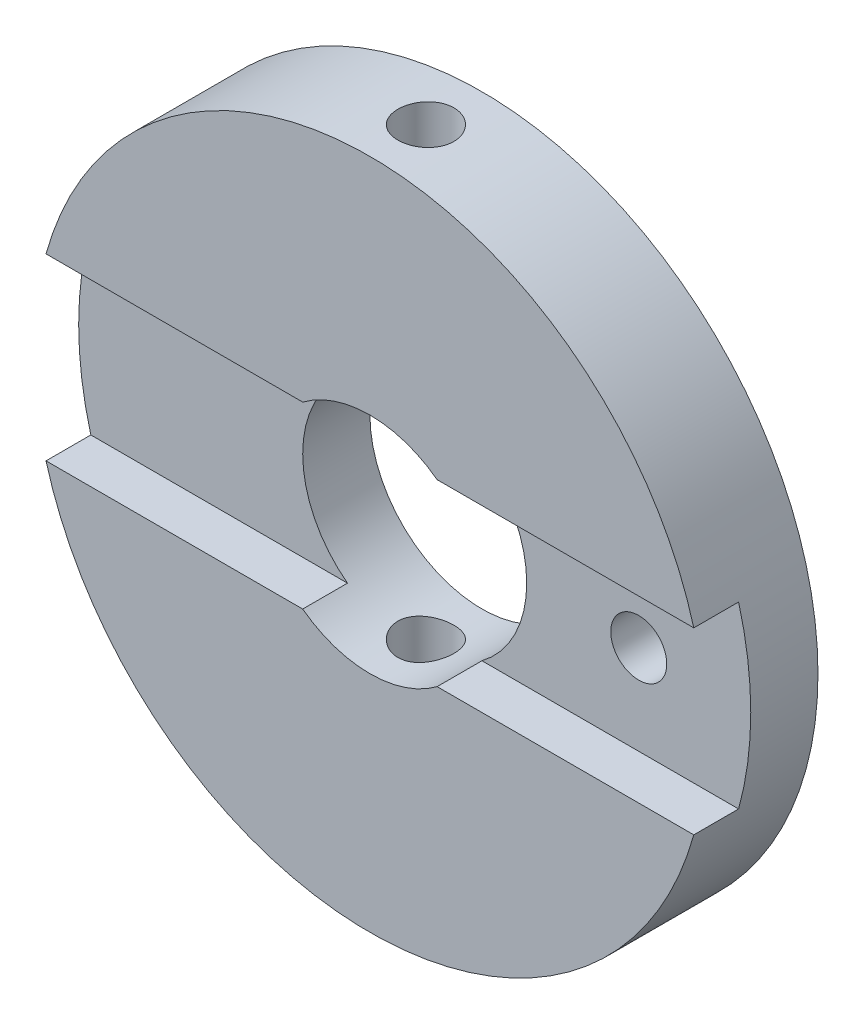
ISO-10303-21;
HEADER;
FILE_DESCRIPTION(('STEP AP214'),'2;1');
FILE_NAME('part.step','',(''),(''),'','','');
FILE_SCHEMA(('AUTOMOTIVE_DESIGN { 1 0 10303 214 1 1 1 1 }'));
ENDSEC;
DATA;
#1=APPLICATION_CONTEXT('core data for automotive mechanical design processes');
#2=APPLICATION_PROTOCOL_DEFINITION('international standard','automotive_design',2000,#1);
#3=PRODUCT_CONTEXT('',#1,'mechanical');
#4=PRODUCT('Part','Part','',(#3));
#5=PRODUCT_RELATED_PRODUCT_CATEGORY('part','',(#4));
#6=PRODUCT_DEFINITION_FORMATION('','',#4);
#7=PRODUCT_DEFINITION_CONTEXT('part definition',#1,'design');
#8=PRODUCT_DEFINITION('design','',#6,#7);
#9=PRODUCT_DEFINITION_SHAPE('','',#8);
#10=(LENGTH_UNIT() NAMED_UNIT(*) SI_UNIT(.MILLI.,.METRE.));
#11=(NAMED_UNIT(*) PLANE_ANGLE_UNIT() SI_UNIT($,.RADIAN.));
#12=(NAMED_UNIT(*) SI_UNIT($,.STERADIAN.) SOLID_ANGLE_UNIT());
#13=UNCERTAINTY_MEASURE_WITH_UNIT(LENGTH_MEASURE(1.E-05),#10,'distance_accuracy_value','');
#14=(GEOMETRIC_REPRESENTATION_CONTEXT(3) GLOBAL_UNCERTAINTY_ASSIGNED_CONTEXT((#13)) GLOBAL_UNIT_ASSIGNED_CONTEXT((#10,
#11,#12)) REPRESENTATION_CONTEXT('',''));
#15=CARTESIAN_POINT('',(0.,0.,0.));
#16=DIRECTION('',(0.,0.,1.));
#17=DIRECTION('',(1.,0.,0.));
#18=AXIS2_PLACEMENT_3D('',#15,#16,#17);
#19=CARTESIAN_POINT('',(0.,0.,5.));
#20=DIRECTION('',(0.,0.,1.));
#21=DIRECTION('',(1.,0.,0.));
#22=AXIS2_PLACEMENT_3D('',#19,#20,#21);
#23=PLANE('',#22);
#24=DIRECTION('',(1.,0.,0.));
#25=VECTOR('',#24,1.);
#26=CARTESIAN_POINT('',(-15.,-4.,5.));
#27=LINE('',#26,#25);
#28=CARTESIAN_POINT('',(-14.456832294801,-4.,5.));
#29=VERTEX_POINT('',#28);
#30=CARTESIAN_POINT('',(-3.,-4.,5.));
#31=VERTEX_POINT('',#30);
#32=EDGE_CURVE('E185',#29,#31,#27,.T.);
#33=ORIENTED_EDGE('',*,*,#32,.F.);
#34=CARTESIAN_POINT('',(0.,0.,5.));
#35=DIRECTION('',(0.,0.,1.));
#36=DIRECTION('',(1.,0.,0.));
#37=AXIS2_PLACEMENT_3D('',#34,#35,#36);
#38=CIRCLE('',#37,15.);
#39=CARTESIAN_POINT('',(14.456832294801,-4.,5.));
#40=VERTEX_POINT('',#39);
#41=EDGE_CURVE('E110',#29,#40,#38,.T.);
#42=ORIENTED_EDGE('',*,*,#41,.T.);
#43=CARTESIAN_POINT('',(3.,-4.,5.));
#44=VERTEX_POINT('',#43);
#45=EDGE_CURVE('E103',#44,#40,#27,.T.);
#46=ORIENTED_EDGE('',*,*,#45,.F.);
#47=CARTESIAN_POINT('',(0.,0.,5.));
#48=DIRECTION('',(0.,0.,1.));
#49=DIRECTION('',(1.,0.,0.));
#50=AXIS2_PLACEMENT_3D('',#47,#48,#49);
#51=CIRCLE('',#50,5.);
#52=EDGE_CURVE('E189',#31,#44,#51,.T.);
#53=ORIENTED_EDGE('',*,*,#52,.F.);
#54=EDGE_LOOP('',(#33,#42,#46,#53));
#55=FACE_BOUND('',#54,.T.);
#56=ADVANCED_FACE('F16',(#55),#23,.T.);
#57=DIRECTION('',(-1.,0.,0.));
#58=VECTOR('',#57,1.);
#59=CARTESIAN_POINT('',(-15.,4.,5.));
#60=LINE('',#59,#58);
#61=CARTESIAN_POINT('',(14.456832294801,4.,5.));
#62=VERTEX_POINT('',#61);
#63=CARTESIAN_POINT('',(3.,4.,5.));
#64=VERTEX_POINT('',#63);
#65=EDGE_CURVE('E88',#62,#64,#60,.T.);
#66=ORIENTED_EDGE('',*,*,#65,.F.);
#67=CARTESIAN_POINT('',(-14.456832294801,4.,5.));
#68=VERTEX_POINT('',#67);
#69=EDGE_CURVE('E100',#62,#68,#38,.T.);
#70=ORIENTED_EDGE('',*,*,#69,.T.);
#71=CARTESIAN_POINT('',(-3.,4.,5.));
#72=VERTEX_POINT('',#71);
#73=EDGE_CURVE('E104',#72,#68,#60,.T.);
#74=ORIENTED_EDGE('',*,*,#73,.F.);
#75=EDGE_CURVE('E102',#64,#72,#51,.T.);
#76=ORIENTED_EDGE('',*,*,#75,.F.);
#77=EDGE_LOOP('',(#66,#70,#74,#76));
#78=FACE_BOUND('',#77,.T.);
#79=ADVANCED_FACE('F98',(#78),#23,.T.);
#80=CARTESIAN_POINT('',(0.,0.,0.));
#81=DIRECTION('',(0.,0.,1.));
#82=DIRECTION('',(1.,0.,0.));
#83=AXIS2_PLACEMENT_3D('',#80,#81,#82);
#84=PLANE('',#83);
#85=CARTESIAN_POINT('',(10.,0.,0.));
#86=DIRECTION('',(0.,0.,1.));
#87=DIRECTION('',(1.,0.,0.));
#88=AXIS2_PLACEMENT_3D('',#85,#86,#87);
#89=CIRCLE('',#88,1.25);
#90=CARTESIAN_POINT('',(11.25,0.,0.));
#91=VERTEX_POINT('',#90);
#92=EDGE_CURVE('E221',#91,#91,#89,.T.);
#93=ORIENTED_EDGE('',*,*,#92,.T.);
#94=EDGE_LOOP('',(#93));
#95=FACE_BOUND('',#94,.T.);
#96=CARTESIAN_POINT('',(0.,0.,0.));
#97=DIRECTION('',(0.,0.,1.));
#98=DIRECTION('',(1.,0.,0.));
#99=AXIS2_PLACEMENT_3D('',#96,#97,#98);
#100=CIRCLE('',#99,15.);
#101=CARTESIAN_POINT('',(15.,0.,0.));
#102=VERTEX_POINT('',#101);
#103=EDGE_CURVE('E116',#102,#102,#100,.T.);
#104=ORIENTED_EDGE('',*,*,#103,.F.);
#105=EDGE_LOOP('',(#104));
#106=FACE_BOUND('',#105,.T.);
#107=CARTESIAN_POINT('',(0.,0.,0.));
#108=DIRECTION('',(0.,0.,1.));
#109=DIRECTION('',(1.,0.,0.));
#110=AXIS2_PLACEMENT_3D('',#107,#108,#109);
#111=CIRCLE('',#110,5.);
#112=CARTESIAN_POINT('',(5.,0.,0.));
#113=VERTEX_POINT('',#112);
#114=EDGE_CURVE('E119',#113,#113,#111,.T.);
#115=ORIENTED_EDGE('',*,*,#114,.T.);
#116=EDGE_LOOP('',(#115));
#117=FACE_BOUND('',#116,.T.);
#118=ADVANCED_FACE('F167',(#95,#106,#117),#84,.F.);
#119=CARTESIAN_POINT('',(0.,0.,5.));
#120=DIRECTION('',(0.,0.,-1.));
#121=DIRECTION('',(-1.,0.,0.));
#122=AXIS2_PLACEMENT_3D('',#119,#120,#121);
#123=CYLINDRICAL_SURFACE('',#122,15.);
#124=CARTESIAN_POINT('',(1.11889664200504E-13,-15.,3.75));
#125=CARTESIAN_POINT('',(0.0700826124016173,-14.9999993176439,3.74999693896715));
#126=CARTESIAN_POINT('',(0.140212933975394,-14.9995036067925,3.7440862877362));
#127=CARTESIAN_POINT('',(0.278533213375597,-14.9975737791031,3.72059456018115));
#128=CARTESIAN_POINT('',(0.346720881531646,-14.9961385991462,3.70300026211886));
#129=CARTESIAN_POINT('',(0.479132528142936,-14.9924920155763,3.65665355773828));
#130=CARTESIAN_POINT('',(0.543358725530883,-14.9902810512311,3.62790746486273));
#131=CARTESIAN_POINT('',(0.666059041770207,-14.9853308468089,3.56008446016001));
#132=CARTESIAN_POINT('',(0.724534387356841,-14.982591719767,3.52100975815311));
#133=CARTESIAN_POINT('',(0.834237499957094,-14.9768847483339,3.4335311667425));
#134=CARTESIAN_POINT('',(0.885448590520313,-14.9739164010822,3.38510639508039));
#135=CARTESIAN_POINT('',(0.979026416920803,-14.9680897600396,3.28034638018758));
#136=CARTESIAN_POINT('',(1.02139276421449,-14.965231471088,3.22401078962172));
#137=CARTESIAN_POINT('',(1.09613490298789,-14.9599431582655,3.10492735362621));
#138=CARTESIAN_POINT('',(1.12849604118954,-14.9575137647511,3.04217028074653));
#139=CARTESIAN_POINT('',(1.18221554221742,-14.9533640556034,2.91208963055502));
#140=CARTESIAN_POINT('',(1.20357409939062,-14.9516437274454,2.84476613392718));
#141=CARTESIAN_POINT('',(1.23463378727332,-14.949111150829,2.70763076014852));
#142=CARTESIAN_POINT('',(1.24436208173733,-14.9482967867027,2.63782507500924));
#143=CARTESIAN_POINT('',(1.2519690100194,-14.9476616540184,2.49756724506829));
#144=CARTESIAN_POINT('',(1.24984786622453,-14.9478408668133,2.42711511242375));
#145=CARTESIAN_POINT('',(1.23383858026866,-14.9491707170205,2.28775041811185));
#146=CARTESIAN_POINT('',(1.21997996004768,-14.9503189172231,2.21883443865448));
#147=CARTESIAN_POINT('',(1.18093498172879,-14.953453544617,2.08431016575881));
#148=CARTESIAN_POINT('',(1.15574851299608,-14.955439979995,2.01870190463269));
#149=CARTESIAN_POINT('',(1.09472973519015,-14.9600300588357,1.89256136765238));
#150=CARTESIAN_POINT('',(1.0588841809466,-14.962634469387,1.83203552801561));
#151=CARTESIAN_POINT('',(0.977574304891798,-14.9681663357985,1.71784832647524));
#152=CARTESIAN_POINT('',(0.932109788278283,-14.9710937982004,1.66418710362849));
#153=CARTESIAN_POINT('',(0.832686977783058,-14.9769527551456,1.56508072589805));
#154=CARTESIAN_POINT('',(0.77870316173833,-14.9798842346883,1.51966116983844));
#155=CARTESIAN_POINT('',(0.663863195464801,-14.9854123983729,1.43852534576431));
#156=CARTESIAN_POINT('',(0.60300704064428,-14.9880090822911,1.40280908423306));
#157=CARTESIAN_POINT('',(0.476133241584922,-14.9925755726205,1.34209529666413));
#158=CARTESIAN_POINT('',(0.410115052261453,-14.994545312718,1.31709890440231));
#159=CARTESIAN_POINT('',(0.27479883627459,-14.9976352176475,1.27855233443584));
#160=CARTESIAN_POINT('',(0.20550087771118,-14.9987554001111,1.26500191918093));
#161=CARTESIAN_POINT('',(0.0658141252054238,-15.0000177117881,1.24976404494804));
#162=CARTESIAN_POINT('',(-0.00457078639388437,-15.00016275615,1.24804122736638));
#163=CARTESIAN_POINT('',(-0.144628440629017,-14.9994662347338,1.25641482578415));
#164=CARTESIAN_POINT('',(-0.214301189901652,-14.9986246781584,1.26651113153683));
#165=CARTESIAN_POINT('',(-0.350855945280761,-14.9960514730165,1.29820707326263));
#166=CARTESIAN_POINT('',(-0.417741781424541,-14.9943210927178,1.31979032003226));
#167=CARTESIAN_POINT('',(-0.546942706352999,-14.9901646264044,1.37383073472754));
#168=CARTESIAN_POINT('',(-0.609257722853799,-14.9877385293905,1.40628807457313));
#169=CARTESIAN_POINT('',(-0.727709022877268,-14.9824553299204,1.48124418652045));
#170=CARTESIAN_POINT('',(-0.783830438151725,-14.9795972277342,1.52376638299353));
#171=CARTESIAN_POINT('',(-0.888151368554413,-14.9737744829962,1.6176113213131));
#172=CARTESIAN_POINT('',(-0.936350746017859,-14.9708098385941,1.66893421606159));
#173=CARTESIAN_POINT('',(-1.02358068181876,-14.9650995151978,1.77907711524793));
#174=CARTESIAN_POINT('',(-1.06258816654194,-14.9623543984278,1.83791542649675));
#175=CARTESIAN_POINT('',(-1.13016882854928,-14.957401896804,1.96132782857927));
#176=CARTESIAN_POINT('',(-1.15874211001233,-14.9551945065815,2.02590186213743));
#177=CARTESIAN_POINT('',(-1.20460397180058,-14.9515705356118,2.15887098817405));
#178=CARTESIAN_POINT('',(-1.2219066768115,-14.9501529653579,2.22726118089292));
#179=CARTESIAN_POINT('',(-1.24478221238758,-14.9482658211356,2.36598837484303));
#180=CARTESIAN_POINT('',(-1.25035526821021,-14.9477962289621,2.43632533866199));
#181=CARTESIAN_POINT('',(-1.24961070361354,-14.9478584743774,2.57672015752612));
#182=CARTESIAN_POINT('',(-1.24332933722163,-14.9483872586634,2.64677820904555));
#183=CARTESIAN_POINT('',(-1.21912982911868,-14.9503801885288,2.78484066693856));
#184=CARTESIAN_POINT('',(-1.20121166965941,-14.951844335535,2.8528450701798));
#185=CARTESIAN_POINT('',(-1.15425638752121,-14.9555422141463,2.98487220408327));
#186=CARTESIAN_POINT('',(-1.12521991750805,-14.9577759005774,3.04889516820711));
#187=CARTESIAN_POINT('',(-1.05685632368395,-14.9627612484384,3.17116355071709));
#188=CARTESIAN_POINT('',(-1.01752936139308,-14.9655129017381,3.22940905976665));
#189=CARTESIAN_POINT('',(-0.929564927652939,-14.9712341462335,3.33865467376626));
#190=CARTESIAN_POINT('',(-0.88090061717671,-14.9742043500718,3.38963313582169));
#191=CARTESIAN_POINT('',(-0.775691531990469,-14.980022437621,3.48271898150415));
#192=CARTESIAN_POINT('',(-0.719144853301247,-14.9828702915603,3.52482421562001));
#193=CARTESIAN_POINT('',(-0.599667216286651,-14.9881279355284,3.59902482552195));
#194=CARTESIAN_POINT('',(-0.53672457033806,-14.9905369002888,3.63110142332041));
#195=CARTESIAN_POINT('',(-0.406369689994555,-14.9946356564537,3.6841897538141));
#196=CARTESIAN_POINT('',(-0.338962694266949,-14.9963262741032,3.70521420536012));
#197=CARTESIAN_POINT('',(-0.225965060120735,-14.9983638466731,3.73024697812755));
#198=CARTESIAN_POINT('',(-0.181101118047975,-14.9989746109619,3.73764451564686));
#199=CARTESIAN_POINT('',(-0.0908314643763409,-14.9997929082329,3.74752201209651));
#200=CARTESIAN_POINT('',(-0.0454257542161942,-15.0000004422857,3.75000198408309));
#201=CARTESIAN_POINT('',(1.11889664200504E-13,-15.,3.75));
#202=B_SPLINE_CURVE_WITH_KNOTS('',3,(#124,#125,#126,#127,#128,#129,#130,#131,#132,#133,#134,
#135,#136,#137,#138,#139,#140,#141,#142,#143,#144,#145,#146,#147,#148,#149,#150,#151,#152,#153,
#154,#155,#156,#157,#158,#159,#160,#161,#162,#163,#164,#165,#166,#167,#168,#169,#170,#171,#172,
#173,#174,#175,#176,#177,#178,#179,#180,#181,#182,#183,#184,#185,#186,#187,#188,#189,#190,#191,
#192,#193,#194,#195,#196,#197,#198,#199,#200,#201),.UNSPECIFIED.,.T.,.F.,(4,2,2,2,2,2,2,2,2,2,2,
2,2,2,2,2,2,2,2,2,2,2,2,2,2,2,2,2,2,2,2,2,2,2,2,2,2,2,4),(0.,0.210081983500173,
0.420402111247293,0.630603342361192,0.840759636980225,1.0513908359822,1.26203128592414,
1.47297878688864,1.68392256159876,1.89437268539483,2.10481885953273,2.31473728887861,
2.52465776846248,2.73484019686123,2.94502688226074,3.15585563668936,3.36668453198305,
3.57753571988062,3.78838253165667,3.99859874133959,4.20881299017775,4.4187281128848,
4.62864655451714,4.83905843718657,5.04947397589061,5.26041220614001,5.47134833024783,
5.68201959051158,5.89268680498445,6.10271078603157,6.31273508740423,6.52274706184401,
6.73275574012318,6.94337735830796,7.15404994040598,7.36511466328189,7.57593595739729,
7.71210607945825,7.8482758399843),.UNSPECIFIED.);
#203=CARTESIAN_POINT('',(1.11889664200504E-13,-15.,3.75));
#204=VERTEX_POINT('',#203);
#205=EDGE_CURVE('E11',#204,#204,#202,.T.);
#206=ORIENTED_EDGE('',*,*,#205,.T.);
#207=EDGE_LOOP('',(#206));
#208=FACE_BOUND('',#207,.T.);
#209=CARTESIAN_POINT('',(1.11889664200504E-13,15.,3.75));
#210=CARTESIAN_POINT('',(-0.0700826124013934,14.9999993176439,3.74999693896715));
#211=CARTESIAN_POINT('',(-0.14021293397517,14.9995036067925,3.7440862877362));
#212=CARTESIAN_POINT('',(-0.278533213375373,14.9975737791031,3.72059456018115));
#213=CARTESIAN_POINT('',(-0.346720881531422,14.9961385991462,3.70300026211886));
#214=CARTESIAN_POINT('',(-0.479132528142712,14.9924920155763,3.65665355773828));
#215=CARTESIAN_POINT('',(-0.543358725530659,14.9902810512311,3.62790746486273));
#216=CARTESIAN_POINT('',(-0.666059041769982,14.9853308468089,3.56008446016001));
#217=CARTESIAN_POINT('',(-0.724534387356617,14.982591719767,3.52100975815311));
#218=CARTESIAN_POINT('',(-0.83423749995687,14.9768847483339,3.4335311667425));
#219=CARTESIAN_POINT('',(-0.88544859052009,14.9739164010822,3.38510639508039));
#220=CARTESIAN_POINT('',(-0.97902641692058,14.9680897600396,3.28034638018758));
#221=CARTESIAN_POINT('',(-1.02139276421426,14.965231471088,3.22401078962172));
#222=CARTESIAN_POINT('',(-1.09613490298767,14.9599431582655,3.10492735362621));
#223=CARTESIAN_POINT('',(-1.12849604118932,14.9575137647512,3.04217028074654));
#224=CARTESIAN_POINT('',(-1.18221554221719,14.9533640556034,2.91208963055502));
#225=CARTESIAN_POINT('',(-1.2035740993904,14.9516437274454,2.84476613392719));
#226=CARTESIAN_POINT('',(-1.23463378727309,14.949111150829,2.70763076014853));
#227=CARTESIAN_POINT('',(-1.24436208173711,14.9482967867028,2.63782507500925));
#228=CARTESIAN_POINT('',(-1.25196901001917,14.9476616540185,2.49756724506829));
#229=CARTESIAN_POINT('',(-1.2498478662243,14.9478408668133,2.42711511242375));
#230=CARTESIAN_POINT('',(-1.23383858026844,14.9491707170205,2.28775041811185));
#231=CARTESIAN_POINT('',(-1.21997996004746,14.9503189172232,2.21883443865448));
#232=CARTESIAN_POINT('',(-1.18093498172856,14.9534535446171,2.08431016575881));
#233=CARTESIAN_POINT('',(-1.15574851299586,14.955439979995,2.01870190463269));
#234=CARTESIAN_POINT('',(-1.09472973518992,14.9600300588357,1.89256136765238));
#235=CARTESIAN_POINT('',(-1.05888418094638,14.962634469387,1.83203552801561));
#236=CARTESIAN_POINT('',(-0.977574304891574,14.9681663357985,1.71784832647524));
#237=CARTESIAN_POINT('',(-0.932109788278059,14.9710937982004,1.66418710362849));
#238=CARTESIAN_POINT('',(-0.832686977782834,14.9769527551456,1.56508072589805));
#239=CARTESIAN_POINT('',(-0.778703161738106,14.9798842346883,1.51966116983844));
#240=CARTESIAN_POINT('',(-0.663863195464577,14.9854123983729,1.43852534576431));
#241=CARTESIAN_POINT('',(-0.603007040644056,14.9880090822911,1.40280908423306));
#242=CARTESIAN_POINT('',(-0.476133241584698,14.9925755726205,1.34209529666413));
#243=CARTESIAN_POINT('',(-0.41011505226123,14.994545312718,1.31709890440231));
#244=CARTESIAN_POINT('',(-0.274798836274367,14.9976352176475,1.27855233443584));
#245=CARTESIAN_POINT('',(-0.205500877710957,14.9987554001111,1.26500191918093));
#246=CARTESIAN_POINT('',(-0.0658141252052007,15.0000177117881,1.24976404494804));
#247=CARTESIAN_POINT('',(0.00457078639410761,15.00016275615,1.24804122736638));
#248=CARTESIAN_POINT('',(0.14462844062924,14.9994662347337,1.25641482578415));
#249=CARTESIAN_POINT('',(0.214301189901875,14.9986246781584,1.26651113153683));
#250=CARTESIAN_POINT('',(0.350855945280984,14.9960514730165,1.29820707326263));
#251=CARTESIAN_POINT('',(0.417741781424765,14.9943210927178,1.31979032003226));
#252=CARTESIAN_POINT('',(0.546942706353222,14.9901646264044,1.37383073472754));
#253=CARTESIAN_POINT('',(0.609257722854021,14.9877385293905,1.40628807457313));
#254=CARTESIAN_POINT('',(0.727709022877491,14.9824553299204,1.48124418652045));
#255=CARTESIAN_POINT('',(0.783830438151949,14.9795972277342,1.52376638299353));
#256=CARTESIAN_POINT('',(0.888151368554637,14.9737744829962,1.6176113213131));
#257=CARTESIAN_POINT('',(0.936350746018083,14.9708098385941,1.66893421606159));
#258=CARTESIAN_POINT('',(1.02358068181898,14.9650995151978,1.77907711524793));
#259=CARTESIAN_POINT('',(1.06258816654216,14.9623543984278,1.83791542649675));
#260=CARTESIAN_POINT('',(1.13016882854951,14.957401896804,1.96132782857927));
#261=CARTESIAN_POINT('',(1.15874211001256,14.9551945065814,2.02590186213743));
#262=CARTESIAN_POINT('',(1.20460397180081,14.9515705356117,2.15887098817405));
#263=CARTESIAN_POINT('',(1.22190667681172,14.9501529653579,2.22726118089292));
#264=CARTESIAN_POINT('',(1.2447822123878,14.9482658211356,2.36598837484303));
#265=CARTESIAN_POINT('',(1.25035526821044,14.9477962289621,2.43632533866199));
#266=CARTESIAN_POINT('',(1.24961070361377,14.9478584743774,2.57672015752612));
#267=CARTESIAN_POINT('',(1.24332933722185,14.9483872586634,2.64677820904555));
#268=CARTESIAN_POINT('',(1.2191298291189,14.9503801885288,2.78484066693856));
#269=CARTESIAN_POINT('',(1.20121166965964,14.9518443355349,2.8528450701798));
#270=CARTESIAN_POINT('',(1.15425638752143,14.9555422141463,2.98487220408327));
#271=CARTESIAN_POINT('',(1.12521991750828,14.9577759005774,3.04889516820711));
#272=CARTESIAN_POINT('',(1.05685632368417,14.9627612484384,3.17116355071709));
#273=CARTESIAN_POINT('',(1.0175293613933,14.9655129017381,3.22940905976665));
#274=CARTESIAN_POINT('',(0.929564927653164,14.9712341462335,3.33865467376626));
#275=CARTESIAN_POINT('',(0.880900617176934,14.9742043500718,3.38963313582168));
#276=CARTESIAN_POINT('',(0.775691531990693,14.980022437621,3.48271898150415));
#277=CARTESIAN_POINT('',(0.719144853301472,14.9828702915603,3.52482421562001));
#278=CARTESIAN_POINT('',(0.599667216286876,14.9881279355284,3.59902482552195));
#279=CARTESIAN_POINT('',(0.536724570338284,14.9905369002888,3.63110142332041));
#280=CARTESIAN_POINT('',(0.40636968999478,14.9946356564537,3.6841897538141));
#281=CARTESIAN_POINT('',(0.338962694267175,14.9963262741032,3.70521420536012));
#282=CARTESIAN_POINT('',(0.22596506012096,14.9983638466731,3.73024697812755));
#283=CARTESIAN_POINT('',(0.1811011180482,14.9989746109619,3.73764451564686));
#284=CARTESIAN_POINT('',(0.0908314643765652,14.9997929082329,3.74752201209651));
#285=CARTESIAN_POINT('',(0.0454257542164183,15.0000004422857,3.75000198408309));
#286=CARTESIAN_POINT('',(1.11889664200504E-13,15.,3.75));
#287=B_SPLINE_CURVE_WITH_KNOTS('',3,(#209,#210,#211,#212,#213,#214,#215,#216,#217,#218,#219,
#220,#221,#222,#223,#224,#225,#226,#227,#228,#229,#230,#231,#232,#233,#234,#235,#236,#237,#238,
#239,#240,#241,#242,#243,#244,#245,#246,#247,#248,#249,#250,#251,#252,#253,#254,#255,#256,#257,
#258,#259,#260,#261,#262,#263,#264,#265,#266,#267,#268,#269,#270,#271,#272,#273,#274,#275,#276,
#277,#278,#279,#280,#281,#282,#283,#284,#285,#286),.UNSPECIFIED.,.T.,.F.,(4,2,2,2,2,2,2,2,2,2,2,
2,2,2,2,2,2,2,2,2,2,2,2,2,2,2,2,2,2,2,2,2,2,2,2,2,2,2,4),(0.,0.210081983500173,
0.420402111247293,0.630603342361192,0.840759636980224,1.0513908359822,1.26203128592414,
1.47297878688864,1.68392256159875,1.89437268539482,2.10481885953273,2.31473728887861,
2.52465776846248,2.73484019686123,2.94502688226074,3.15585563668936,3.36668453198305,
3.57753571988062,3.78838253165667,3.99859874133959,4.20881299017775,4.4187281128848,
4.62864655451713,4.83905843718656,5.04947397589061,5.26041220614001,5.47134833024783,
5.68201959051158,5.89268680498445,6.10271078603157,6.31273508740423,6.52274706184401,
6.73275574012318,6.94337735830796,7.15404994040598,7.36511466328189,7.57593595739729,
7.71210607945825,7.8482758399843),.UNSPECIFIED.);
#288=CARTESIAN_POINT('',(1.11889664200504E-13,15.,3.75));
#289=VERTEX_POINT('',#288);
#290=EDGE_CURVE('E128',#289,#289,#287,.T.);
#291=ORIENTED_EDGE('',*,*,#290,.T.);
#292=EDGE_LOOP('',(#291));
#293=FACE_BOUND('',#292,.T.);
#294=CARTESIAN_POINT('',(0.,0.,3.));
#295=DIRECTION('',(0.,0.,-1.));
#296=DIRECTION('',(-1.,0.,0.));
#297=AXIS2_PLACEMENT_3D('',#294,#295,#296);
#298=CIRCLE('',#297,15.);
#299=CARTESIAN_POINT('',(14.456832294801,4.,3.));
#300=VERTEX_POINT('',#299);
#301=CARTESIAN_POINT('',(14.456832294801,-4.,3.));
#302=VERTEX_POINT('',#301);
#303=EDGE_CURVE('E198',#300,#302,#298,.T.);
#304=ORIENTED_EDGE('',*,*,#303,.T.);
#305=DIRECTION('',(0.,0.,-1.));
#306=VECTOR('',#305,1.);
#307=CARTESIAN_POINT('',(14.456832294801,-4.,5.));
#308=LINE('',#307,#306);
#309=EDGE_CURVE('E92',#302,#40,#308,.F.);
#310=ORIENTED_EDGE('',*,*,#309,.T.);
#311=ORIENTED_EDGE('',*,*,#41,.F.);
#312=DIRECTION('',(0.,0.,-1.));
#313=VECTOR('',#312,1.);
#314=CARTESIAN_POINT('',(-14.456832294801,-4.,5.));
#315=LINE('',#314,#313);
#316=CARTESIAN_POINT('',(-14.456832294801,-4.,3.));
#317=VERTEX_POINT('',#316);
#318=EDGE_CURVE('E196',#29,#317,#315,.T.);
#319=ORIENTED_EDGE('',*,*,#318,.T.);
#320=CARTESIAN_POINT('',(-14.456832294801,4.,3.));
#321=VERTEX_POINT('',#320);
#322=EDGE_CURVE('E215',#317,#321,#298,.T.);
#323=ORIENTED_EDGE('',*,*,#322,.T.);
#324=DIRECTION('',(0.,0.,-1.));
#325=VECTOR('',#324,1.);
#326=CARTESIAN_POINT('',(-14.456832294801,4.,5.));
#327=LINE('',#326,#325);
#328=EDGE_CURVE('E93',#321,#68,#327,.F.);
#329=ORIENTED_EDGE('',*,*,#328,.T.);
#330=ORIENTED_EDGE('',*,*,#69,.F.);
#331=DIRECTION('',(0.,0.,-1.));
#332=VECTOR('',#331,1.);
#333=CARTESIAN_POINT('',(14.456832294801,4.,5.));
#334=LINE('',#333,#332);
#335=EDGE_CURVE('E85',#62,#300,#334,.T.);
#336=ORIENTED_EDGE('',*,*,#335,.T.);
#337=EDGE_LOOP('',(#304,#310,#311,#319,#323,#329,#330,#336));
#338=FACE_BOUND('',#337,.T.);
#339=ORIENTED_EDGE('',*,*,#103,.T.);
#340=EDGE_LOOP('',(#339));
#341=FACE_BOUND('',#340,.T.);
#342=ADVANCED_FACE('F18',(#208,#293,#338,#341),#123,.T.);
#343=CARTESIAN_POINT('',(0.,0.,5.));
#344=DIRECTION('',(0.,0.,-1.));
#345=DIRECTION('',(-1.,0.,0.));
#346=AXIS2_PLACEMENT_3D('',#343,#344,#345);
#347=CYLINDRICAL_SURFACE('',#346,5.);
#348=CARTESIAN_POINT('',(1.11889664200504E-13,-5.,3.75));
#349=CARTESIAN_POINT('',(0.0690634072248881,-4.99999883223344,3.74999806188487));
#350=CARTESIAN_POINT('',(0.138148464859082,-4.99855481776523,3.74425704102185));
#351=CARTESIAN_POINT('',(0.274338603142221,-4.99293428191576,3.72147904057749));
#352=CARTESIAN_POINT('',(0.341442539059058,-4.98875621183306,3.70443565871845));
#353=CARTESIAN_POINT('',(0.471684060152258,-4.97813021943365,3.65963395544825));
#354=CARTESIAN_POINT('',(0.534826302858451,-4.97168502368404,3.6318885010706));
#355=CARTESIAN_POINT('',(0.655560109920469,-4.95721119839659,3.56651550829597));
#356=CARTESIAN_POINT('',(0.713151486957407,-4.9491825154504,3.52888763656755));
#357=CARTESIAN_POINT('',(0.822334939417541,-4.93222844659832,3.44399934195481));
#358=CARTESIAN_POINT('',(0.873796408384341,-4.92328922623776,3.39657368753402));
#359=CARTESIAN_POINT('',(0.968124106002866,-4.90561350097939,3.29378982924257));
#360=CARTESIAN_POINT('',(1.01098936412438,-4.89687701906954,3.23843073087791));
#361=CARTESIAN_POINT('',(1.0875221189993,-4.88045646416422,3.12033731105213));
#362=CARTESIAN_POINT('',(1.12104351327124,-4.87278995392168,3.05750564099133));
#363=CARTESIAN_POINT('',(1.17699742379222,-4.85957912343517,2.92687632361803));
#364=CARTESIAN_POINT('',(1.19943171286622,-4.85403446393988,2.85907947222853));
#365=CARTESIAN_POINT('',(1.23212903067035,-4.84583730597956,2.7218804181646));
#366=CARTESIAN_POINT('',(1.24262689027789,-4.84312909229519,2.65253758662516));
#367=CARTESIAN_POINT('',(1.25188481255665,-4.84074468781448,2.51302619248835));
#368=CARTESIAN_POINT('',(1.25064678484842,-4.84106800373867,2.44285776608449));
#369=CARTESIAN_POINT('',(1.2366554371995,-4.84466004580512,2.3054868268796));
#370=CARTESIAN_POINT('',(1.22418195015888,-4.8478571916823,2.23825364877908));
#371=CARTESIAN_POINT('',(1.1885201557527,-4.85672258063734,2.10686579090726));
#372=CARTESIAN_POINT('',(1.16533108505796,-4.86239099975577,2.04271133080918));
#373=CARTESIAN_POINT('',(1.10865789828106,-4.87562594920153,1.91855165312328));
#374=CARTESIAN_POINT('',(1.0750722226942,-4.88321106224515,1.85859485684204));
#375=CARTESIAN_POINT('',(0.998630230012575,-4.89941425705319,1.7450677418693));
#376=CARTESIAN_POINT('',(0.955772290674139,-4.9080325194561,1.69149854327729));
#377=CARTESIAN_POINT('',(0.86055285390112,-4.92563233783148,1.59066365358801));
#378=CARTESIAN_POINT('',(0.807955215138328,-4.93461724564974,1.54362125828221));
#379=CARTESIAN_POINT('',(0.695509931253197,-4.9517163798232,1.45898229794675));
#380=CARTESIAN_POINT('',(0.635662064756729,-4.95983057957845,1.42138602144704));
#381=CARTESIAN_POINT('',(0.510096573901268,-4.97431443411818,1.35662451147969));
#382=CARTESIAN_POINT('',(0.444359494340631,-4.98067800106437,1.32949554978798));
#383=CARTESIAN_POINT('',(0.309063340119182,-4.99089930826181,1.28673557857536));
#384=CARTESIAN_POINT('',(0.239504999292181,-4.99475752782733,1.27110236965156));
#385=CARTESIAN_POINT('',(0.100449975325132,-4.99946249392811,1.25211869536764));
#386=CARTESIAN_POINT('',(0.0309972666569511,-5.00038377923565,1.24846414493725));
#387=CARTESIAN_POINT('',(-0.107527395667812,-4.99932337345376,1.25270750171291));
#388=CARTESIAN_POINT('',(-0.17659938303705,-4.99734194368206,1.26060436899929));
#389=CARTESIAN_POINT('',(-0.311345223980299,-4.99074650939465,1.28747575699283));
#390=CARTESIAN_POINT('',(-0.377054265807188,-4.98617195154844,1.30628438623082));
#391=CARTESIAN_POINT('',(-0.50438107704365,-4.97490588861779,1.35425590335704));
#392=CARTESIAN_POINT('',(-0.565998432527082,-4.96821416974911,1.38341983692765));
#393=CARTESIAN_POINT('',(-0.684602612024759,-4.9532775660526,1.45186344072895));
#394=CARTESIAN_POINT('',(-0.741487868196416,-4.94500722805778,1.4913134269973));
#395=CARTESIAN_POINT('',(-0.847938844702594,-4.92787090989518,1.57899159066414));
#396=CARTESIAN_POINT('',(-0.897503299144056,-4.91900482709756,1.6272212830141));
#397=CARTESIAN_POINT('',(-0.989158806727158,-4.90140797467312,1.73250163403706));
#398=CARTESIAN_POINT('',(-1.03103655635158,-4.89268586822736,1.78973975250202));
#399=CARTESIAN_POINT('',(-1.10459229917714,-4.87660731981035,1.91061052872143));
#400=CARTESIAN_POINT('',(-1.13627074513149,-4.86925081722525,1.97424290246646));
#401=CARTESIAN_POINT('',(-1.18829285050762,-4.85681745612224,2.10575476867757));
#402=CARTESIAN_POINT('',(-1.20870366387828,-4.85172712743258,2.17360635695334));
#403=CARTESIAN_POINT('',(-1.23778804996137,-4.84438953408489,2.31192469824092));
#404=CARTESIAN_POINT('',(-1.24646418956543,-4.84214164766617,2.38239087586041));
#405=CARTESIAN_POINT('',(-1.25169882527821,-4.84079084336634,2.52176751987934));
#406=CARTESIAN_POINT('',(-1.24859824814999,-4.84159943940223,2.59066452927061));
#407=CARTESIAN_POINT('',(-1.23114773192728,-4.84606590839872,2.72691990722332));
#408=CARTESIAN_POINT('',(-1.21679801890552,-4.84972372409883,2.79427830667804));
#409=CARTESIAN_POINT('',(-1.17744276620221,-4.85942717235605,2.92517371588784));
#410=CARTESIAN_POINT('',(-1.15250117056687,-4.8654584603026,2.98873108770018));
#411=CARTESIAN_POINT('',(-1.09272076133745,-4.87923129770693,3.11080448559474));
#412=CARTESIAN_POINT('',(-1.05788057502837,-4.8869730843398,3.1693198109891));
#413=CARTESIAN_POINT('',(-0.978223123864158,-4.90354695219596,3.28129552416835));
#414=CARTESIAN_POINT('',(-0.933169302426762,-4.91240220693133,3.33458422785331));
#415=CARTESIAN_POINT('',(-0.83482447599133,-4.93006689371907,3.43295587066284));
#416=CARTESIAN_POINT('',(-0.781531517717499,-4.93887631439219,3.47803685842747));
#417=CARTESIAN_POINT('',(-0.667056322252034,-4.95564713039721,3.55950942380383));
#418=CARTESIAN_POINT('',(-0.605748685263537,-4.96359027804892,3.59572884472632));
#419=CARTESIAN_POINT('',(-0.477721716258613,-4.97754104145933,3.65728955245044));
#420=CARTESIAN_POINT('',(-0.411006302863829,-4.98355004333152,3.68263863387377));
#421=CARTESIAN_POINT('',(-0.28700854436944,-4.99206716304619,3.7179765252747));
#422=CARTESIAN_POINT('',(-0.23031680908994,-4.99502154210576,3.72995936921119));
#423=CARTESIAN_POINT('',(-0.115755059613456,-4.9989883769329,3.74597161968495));
#424=CARTESIAN_POINT('',(-0.0578851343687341,-5.00000097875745,3.75000162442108));
#425=CARTESIAN_POINT('',(1.11889664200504E-13,-5.,3.75));
#426=B_SPLINE_CURVE_WITH_KNOTS('',3,(#348,#349,#350,#351,#352,#353,#354,#355,#356,#357,#358,
#359,#360,#361,#362,#363,#364,#365,#366,#367,#368,#369,#370,#371,#372,#373,#374,#375,#376,#377,
#378,#379,#380,#381,#382,#383,#384,#385,#386,#387,#388,#389,#390,#391,#392,#393,#394,#395,#396,
#397,#398,#399,#400,#401,#402,#403,#404,#405,#406,#407,#408,#409,#410,#411,#412,#413,#414,#415,
#416,#417,#418,#419,#420,#421,#422,#423,#424,#425),.UNSPECIFIED.,.T.,.F.,(4,2,2,2,2,2,2,2,2,2,2,
2,2,2,2,2,2,2,2,2,2,2,2,2,2,2,2,2,2,2,2,2,2,2,2,2,2,2,4),(0.,0.206978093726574,
0.414073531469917,0.62092075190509,0.827774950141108,1.03845362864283,1.24915607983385,
1.46298872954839,1.6767871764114,1.88630245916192,2.09578365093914,2.30018747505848,
2.50460586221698,2.71108773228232,2.91760575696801,3.13001250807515,3.34242574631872,
3.55556857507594,3.76867061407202,3.97631924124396,4.18394917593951,4.38850228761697,
4.59307606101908,4.80127989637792,5.00951969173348,5.22287091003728,5.43621265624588,
5.64826878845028,5.86027852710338,6.06619816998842,6.2721136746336,6.47680333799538,
6.68152140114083,6.8915798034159,7.10168808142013,7.31560154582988,7.5293613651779,
7.70285202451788,7.87632963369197),.UNSPECIFIED.);
#427=CARTESIAN_POINT('',(1.11889664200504E-13,-5.,3.75));
#428=VERTEX_POINT('',#427);
#429=EDGE_CURVE('E152',#428,#428,#426,.T.);
#430=ORIENTED_EDGE('',*,*,#429,.F.);
#431=EDGE_LOOP('',(#430));
#432=FACE_BOUND('',#431,.T.);
#433=CARTESIAN_POINT('',(1.11889664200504E-13,5.,3.75));
#434=CARTESIAN_POINT('',(-0.0690634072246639,4.99999883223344,3.74999806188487));
#435=CARTESIAN_POINT('',(-0.138148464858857,4.99855481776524,3.74425704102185));
#436=CARTESIAN_POINT('',(-0.274338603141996,4.99293428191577,3.72147904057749));
#437=CARTESIAN_POINT('',(-0.341442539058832,4.98875621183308,3.70443565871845));
#438=CARTESIAN_POINT('',(-0.471684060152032,4.97813021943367,3.65963395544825));
#439=CARTESIAN_POINT('',(-0.534826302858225,4.97168502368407,3.6318885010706));
#440=CARTESIAN_POINT('',(-0.655560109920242,4.95721119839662,3.56651550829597));
#441=CARTESIAN_POINT('',(-0.71315148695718,4.94918251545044,3.52888763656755));
#442=CARTESIAN_POINT('',(-0.822334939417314,4.93222844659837,3.44399934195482));
#443=CARTESIAN_POINT('',(-0.873796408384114,4.9232892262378,3.39657368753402));
#444=CARTESIAN_POINT('',(-0.968124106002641,4.90561350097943,3.29378982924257));
#445=CARTESIAN_POINT('',(-1.01098936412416,4.89687701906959,3.23843073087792));
#446=CARTESIAN_POINT('',(-1.08752211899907,4.88045646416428,3.12033731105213));
#447=CARTESIAN_POINT('',(-1.12104351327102,4.87278995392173,3.05750564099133));
#448=CARTESIAN_POINT('',(-1.17699742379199,4.85957912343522,2.92687632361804));
#449=CARTESIAN_POINT('',(-1.19943171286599,4.85403446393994,2.85907947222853));
#450=CARTESIAN_POINT('',(-1.23212903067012,4.84583730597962,2.72188041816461));
#451=CARTESIAN_POINT('',(-1.24262689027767,4.84312909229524,2.65253758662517));
#452=CARTESIAN_POINT('',(-1.25188481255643,4.84074468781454,2.51302619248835));
#453=CARTESIAN_POINT('',(-1.25064678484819,4.84106800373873,2.4428577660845));
#454=CARTESIAN_POINT('',(-1.23665543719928,4.84466004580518,2.3054868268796));
#455=CARTESIAN_POINT('',(-1.22418195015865,4.84785719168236,2.23825364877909));
#456=CARTESIAN_POINT('',(-1.18852015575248,4.85672258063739,2.10686579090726));
#457=CARTESIAN_POINT('',(-1.16533108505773,4.86239099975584,2.04271133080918));
#458=CARTESIAN_POINT('',(-1.10865789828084,4.87562594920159,1.91855165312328));
#459=CARTESIAN_POINT('',(-1.07507222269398,4.8832110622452,1.85859485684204));
#460=CARTESIAN_POINT('',(-0.998630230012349,4.89941425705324,1.7450677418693));
#461=CARTESIAN_POINT('',(-0.955772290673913,4.90803251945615,1.69149854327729));
#462=CARTESIAN_POINT('',(-0.860552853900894,4.92563233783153,1.590663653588));
#463=CARTESIAN_POINT('',(-0.807955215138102,4.93461724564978,1.54362125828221));
#464=CARTESIAN_POINT('',(-0.69550993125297,4.95171637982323,1.45898229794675));
#465=CARTESIAN_POINT('',(-0.635662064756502,4.95983057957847,1.42138602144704));
#466=CARTESIAN_POINT('',(-0.510096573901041,4.9743144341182,1.35662451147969));
#467=CARTESIAN_POINT('',(-0.444359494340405,4.98067800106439,1.32949554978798));
#468=CARTESIAN_POINT('',(-0.309063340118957,4.99089930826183,1.28673557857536));
#469=CARTESIAN_POINT('',(-0.239504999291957,4.99475752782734,1.27110236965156));
#470=CARTESIAN_POINT('',(-0.100449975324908,4.99946249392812,1.25211869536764));
#471=CARTESIAN_POINT('',(-0.0309972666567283,5.00038377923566,1.24846414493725));
#472=CARTESIAN_POINT('',(0.107527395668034,4.99932337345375,1.25270750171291));
#473=CARTESIAN_POINT('',(0.176599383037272,4.99734194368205,1.26060436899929));
#474=CARTESIAN_POINT('',(0.311345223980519,4.99074650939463,1.28747575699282));
#475=CARTESIAN_POINT('',(0.377054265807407,4.98617195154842,1.30628438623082));
#476=CARTESIAN_POINT('',(0.504381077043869,4.97490588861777,1.35425590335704));
#477=CARTESIAN_POINT('',(0.565998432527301,4.96821416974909,1.38341983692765));
#478=CARTESIAN_POINT('',(0.684602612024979,4.95327756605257,1.45186344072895));
#479=CARTESIAN_POINT('',(0.741487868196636,4.94500722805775,1.4913134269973));
#480=CARTESIAN_POINT('',(0.847938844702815,4.92787090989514,1.57899159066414));
#481=CARTESIAN_POINT('',(0.897503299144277,4.91900482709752,1.62722128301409));
#482=CARTESIAN_POINT('',(0.989158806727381,4.90140797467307,1.73250163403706));
#483=CARTESIAN_POINT('',(1.03103655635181,4.89268586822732,1.78973975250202));
#484=CARTESIAN_POINT('',(1.10459229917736,4.8766073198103,1.91061052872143));
#485=CARTESIAN_POINT('',(1.13627074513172,4.86925081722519,1.97424290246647));
#486=CARTESIAN_POINT('',(1.18829285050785,4.85681745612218,2.10575476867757));
#487=CARTESIAN_POINT('',(1.2087036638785,4.85172712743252,2.17360635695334));
#488=CARTESIAN_POINT('',(1.23778804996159,4.84438953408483,2.31192469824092));
#489=CARTESIAN_POINT('',(1.24646418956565,4.84214164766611,2.38239087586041));
#490=CARTESIAN_POINT('',(1.25169882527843,4.84079084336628,2.52176751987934));
#491=CARTESIAN_POINT('',(1.24859824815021,4.84159943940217,2.59066452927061));
#492=CARTESIAN_POINT('',(1.2311477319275,4.84606590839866,2.72691990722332));
#493=CARTESIAN_POINT('',(1.21679801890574,4.84972372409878,2.79427830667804));
#494=CARTESIAN_POINT('',(1.17744276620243,4.859427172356,2.92517371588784));
#495=CARTESIAN_POINT('',(1.15250117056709,4.86545846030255,2.98873108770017));
#496=CARTESIAN_POINT('',(1.09272076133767,4.87923129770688,3.11080448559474));
#497=CARTESIAN_POINT('',(1.05788057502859,4.88697308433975,3.16931981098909));
#498=CARTESIAN_POINT('',(0.978223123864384,4.90354695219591,3.28129552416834));
#499=CARTESIAN_POINT('',(0.933169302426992,4.91240220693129,3.3345842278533));
#500=CARTESIAN_POINT('',(0.834824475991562,4.93006689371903,3.43295587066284));
#501=CARTESIAN_POINT('',(0.781531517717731,4.93887631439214,3.47803685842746));
#502=CARTESIAN_POINT('',(0.667056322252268,4.95564713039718,3.55950942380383));
#503=CARTESIAN_POINT('',(0.605748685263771,4.96359027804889,3.59572884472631));
#504=CARTESIAN_POINT('',(0.477721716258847,4.97754104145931,3.65728955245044));
#505=CARTESIAN_POINT('',(0.411006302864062,4.9835500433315,3.68263863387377));
#506=CARTESIAN_POINT('',(0.287008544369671,4.99206716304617,3.7179765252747));
#507=CARTESIAN_POINT('',(0.23031680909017,4.99502154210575,3.72995936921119));
#508=CARTESIAN_POINT('',(0.115755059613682,4.9989883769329,3.74597161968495));
#509=CARTESIAN_POINT('',(0.0578851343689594,5.00000097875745,3.75000162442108));
#510=CARTESIAN_POINT('',(1.11889664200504E-13,5.,3.75));
#511=B_SPLINE_CURVE_WITH_KNOTS('',3,(#433,#434,#435,#436,#437,#438,#439,#440,#441,#442,#443,
#444,#445,#446,#447,#448,#449,#450,#451,#452,#453,#454,#455,#456,#457,#458,#459,#460,#461,#462,
#463,#464,#465,#466,#467,#468,#469,#470,#471,#472,#473,#474,#475,#476,#477,#478,#479,#480,#481,
#482,#483,#484,#485,#486,#487,#488,#489,#490,#491,#492,#493,#494,#495,#496,#497,#498,#499,#500,
#501,#502,#503,#504,#505,#506,#507,#508,#509,#510),.UNSPECIFIED.,.T.,.F.,(4,2,2,2,2,2,2,2,2,2,2,
2,2,2,2,2,2,2,2,2,2,2,2,2,2,2,2,2,2,2,2,2,2,2,2,2,2,2,4),(0.,0.206978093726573,
0.414073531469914,0.620920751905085,0.827774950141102,1.03845362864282,1.24915607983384,
1.46298872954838,1.67678717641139,1.88630245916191,2.09578365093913,2.30018747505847,
2.50460586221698,2.71108773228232,2.91760575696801,3.13001250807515,3.34242574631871,
3.55556857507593,3.768670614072,3.97631924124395,4.1839491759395,4.38850228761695,
4.59307606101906,4.80127989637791,5.00951969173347,5.22287091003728,5.43621265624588,
5.64826878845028,5.86027852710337,6.06619816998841,6.2721136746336,6.47680333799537,
6.68152140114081,6.89157980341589,7.10168808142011,7.31560154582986,7.52936136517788,
7.70285202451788,7.87632963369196),.UNSPECIFIED.);
#512=CARTESIAN_POINT('',(1.11889664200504E-13,5.,3.75));
#513=VERTEX_POINT('',#512);
#514=EDGE_CURVE('E133',#513,#513,#511,.T.);
#515=ORIENTED_EDGE('',*,*,#514,.F.);
#516=EDGE_LOOP('',(#515));
#517=FACE_BOUND('',#516,.T.);
#518=DIRECTION('',(0.,0.,-1.));
#519=VECTOR('',#518,1.);
#520=CARTESIAN_POINT('',(3.,-4.,5.));
#521=LINE('',#520,#519);
#522=CARTESIAN_POINT('',(3.,-4.,3.));
#523=VERTEX_POINT('',#522);
#524=EDGE_CURVE('E29',#523,#44,#521,.F.);
#525=ORIENTED_EDGE('',*,*,#524,.F.);
#526=CARTESIAN_POINT('',(0.,0.,3.));
#527=DIRECTION('',(0.,0.,-1.));
#528=DIRECTION('',(-1.,0.,0.));
#529=AXIS2_PLACEMENT_3D('',#526,#527,#528);
#530=CIRCLE('',#529,5.);
#531=CARTESIAN_POINT('',(3.,4.,3.));
#532=VERTEX_POINT('',#531);
#533=EDGE_CURVE('E114',#532,#523,#530,.T.);
#534=ORIENTED_EDGE('',*,*,#533,.F.);
#535=DIRECTION('',(0.,0.,-1.));
#536=VECTOR('',#535,1.);
#537=CARTESIAN_POINT('',(3.,4.,5.));
#538=LINE('',#537,#536);
#539=EDGE_CURVE('E126',#64,#532,#538,.T.);
#540=ORIENTED_EDGE('',*,*,#539,.F.);
#541=ORIENTED_EDGE('',*,*,#75,.T.);
#542=DIRECTION('',(0.,0.,-1.));
#543=VECTOR('',#542,1.);
#544=CARTESIAN_POINT('',(-3.,4.,5.));
#545=LINE('',#544,#543);
#546=CARTESIAN_POINT('',(-3.,4.,3.));
#547=VERTEX_POINT('',#546);
#548=EDGE_CURVE('E112',#547,#72,#545,.F.);
#549=ORIENTED_EDGE('',*,*,#548,.F.);
#550=CARTESIAN_POINT('',(-3.,-4.,3.));
#551=VERTEX_POINT('',#550);
#552=EDGE_CURVE('E109',#551,#547,#530,.T.);
#553=ORIENTED_EDGE('',*,*,#552,.F.);
#554=DIRECTION('',(0.,0.,-1.));
#555=VECTOR('',#554,1.);
#556=CARTESIAN_POINT('',(-3.,-4.,5.));
#557=LINE('',#556,#555);
#558=EDGE_CURVE('E124',#31,#551,#557,.T.);
#559=ORIENTED_EDGE('',*,*,#558,.F.);
#560=ORIENTED_EDGE('',*,*,#52,.T.);
#561=EDGE_LOOP('',(#525,#534,#540,#541,#549,#553,#559,#560));
#562=FACE_BOUND('',#561,.T.);
#563=ORIENTED_EDGE('',*,*,#114,.F.);
#564=EDGE_LOOP('',(#563));
#565=FACE_BOUND('',#564,.T.);
#566=ADVANCED_FACE('F157',(#432,#517,#562,#565),#347,.F.);
#567=CARTESIAN_POINT('',(0.,0.,3.));
#568=DIRECTION('',(0.,0.,-1.));
#569=DIRECTION('',(-1.,0.,0.));
#570=AXIS2_PLACEMENT_3D('',#567,#568,#569);
#571=PLANE('',#570);
#572=ORIENTED_EDGE('',*,*,#322,.F.);
#573=DIRECTION('',(1.,0.,0.));
#574=VECTOR('',#573,1.);
#575=CARTESIAN_POINT('',(-15.,-4.,3.));
#576=LINE('',#575,#574);
#577=EDGE_CURVE('E44',#317,#551,#576,.T.);
#578=ORIENTED_EDGE('',*,*,#577,.T.);
#579=ORIENTED_EDGE('',*,*,#552,.T.);
#580=DIRECTION('',(-1.,0.,0.));
#581=VECTOR('',#580,1.);
#582=CARTESIAN_POINT('',(-15.,4.,3.));
#583=LINE('',#582,#581);
#584=EDGE_CURVE('E192',#547,#321,#583,.T.);
#585=ORIENTED_EDGE('',*,*,#584,.T.);
#586=EDGE_LOOP('',(#572,#578,#579,#585));
#587=FACE_BOUND('',#586,.T.);
#588=ADVANCED_FACE('F162',(#587),#571,.F.);
#589=CARTESIAN_POINT('',(-15.,4.,3.));
#590=DIRECTION('',(0.,1.,0.));
#591=DIRECTION('',(0.,0.,1.));
#592=AXIS2_PLACEMENT_3D('',#589,#590,#591);
#593=PLANE('',#592);
#594=ORIENTED_EDGE('',*,*,#584,.F.);
#595=ORIENTED_EDGE('',*,*,#548,.T.);
#596=ORIENTED_EDGE('',*,*,#73,.T.);
#597=ORIENTED_EDGE('',*,*,#328,.F.);
#598=EDGE_LOOP('',(#594,#595,#596,#597));
#599=FACE_BOUND('',#598,.T.);
#600=ADVANCED_FACE('F232',(#599),#593,.F.);
#601=CARTESIAN_POINT('',(-15.,-4.,3.));
#602=DIRECTION('',(0.,-1.,0.));
#603=DIRECTION('',(0.,0.,-1.));
#604=AXIS2_PLACEMENT_3D('',#601,#602,#603);
#605=PLANE('',#604);
#606=ORIENTED_EDGE('',*,*,#32,.T.);
#607=ORIENTED_EDGE('',*,*,#558,.T.);
#608=ORIENTED_EDGE('',*,*,#577,.F.);
#609=ORIENTED_EDGE('',*,*,#318,.F.);
#610=EDGE_LOOP('',(#606,#607,#608,#609));
#611=FACE_BOUND('',#610,.T.);
#612=ADVANCED_FACE('F214',(#611),#605,.F.);
#613=EDGE_CURVE('E216',#523,#302,#576,.T.);
#614=ORIENTED_EDGE('',*,*,#613,.F.);
#615=ORIENTED_EDGE('',*,*,#524,.T.);
#616=ORIENTED_EDGE('',*,*,#45,.T.);
#617=ORIENTED_EDGE('',*,*,#309,.F.);
#618=EDGE_LOOP('',(#614,#615,#616,#617));
#619=FACE_BOUND('',#618,.T.);
#620=ADVANCED_FACE('F222',(#619),#605,.F.);
#621=ORIENTED_EDGE('',*,*,#65,.T.);
#622=ORIENTED_EDGE('',*,*,#539,.T.);
#623=EDGE_CURVE('E36',#300,#532,#583,.T.);
#624=ORIENTED_EDGE('',*,*,#623,.F.);
#625=ORIENTED_EDGE('',*,*,#335,.F.);
#626=EDGE_LOOP('',(#621,#622,#624,#625));
#627=FACE_BOUND('',#626,.T.);
#628=ADVANCED_FACE('F87',(#627),#593,.F.);
#629=CARTESIAN_POINT('',(10.,0.,3.));
#630=DIRECTION('',(0.,0.,1.));
#631=DIRECTION('',(1.,0.,0.));
#632=AXIS2_PLACEMENT_3D('',#629,#630,#631);
#633=CIRCLE('',#632,1.25);
#634=CARTESIAN_POINT('',(11.25,0.,3.));
#635=VERTEX_POINT('',#634);
#636=EDGE_CURVE('E331',#635,#635,#633,.T.);
#637=ORIENTED_EDGE('',*,*,#636,.F.);
#638=EDGE_LOOP('',(#637));
#639=FACE_BOUND('',#638,.T.);
#640=ORIENTED_EDGE('',*,*,#623,.T.);
#641=ORIENTED_EDGE('',*,*,#533,.T.);
#642=ORIENTED_EDGE('',*,*,#613,.T.);
#643=ORIENTED_EDGE('',*,*,#303,.F.);
#644=EDGE_LOOP('',(#640,#641,#642,#643));
#645=FACE_BOUND('',#644,.T.);
#646=ADVANCED_FACE('F223',(#639,#645),#571,.F.);
#647=CARTESIAN_POINT('',(10.,0.,3.));
#648=DIRECTION('',(0.,0.,1.));
#649=DIRECTION('',(1.,0.,0.));
#650=AXIS2_PLACEMENT_3D('',#647,#648,#649);
#651=CYLINDRICAL_SURFACE('',#650,1.25);
#652=ORIENTED_EDGE('',*,*,#92,.F.);
#653=EDGE_LOOP('',(#652));
#654=FACE_BOUND('',#653,.T.);
#655=ORIENTED_EDGE('',*,*,#636,.T.);
#656=EDGE_LOOP('',(#655));
#657=FACE_BOUND('',#656,.T.);
#658=ADVANCED_FACE('F140',(#654,#657),#651,.F.);
#659=CARTESIAN_POINT('',(1.11889664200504E-13,16.,2.5));
#660=DIRECTION('',(0.,1.,0.));
#661=DIRECTION('',(0.,0.,1.));
#662=AXIS2_PLACEMENT_3D('',#659,#660,#661);
#663=CYLINDRICAL_SURFACE('',#662,1.25);
#664=ORIENTED_EDGE('',*,*,#514,.T.);
#665=EDGE_LOOP('',(#664));
#666=FACE_BOUND('',#665,.T.);
#667=ORIENTED_EDGE('',*,*,#290,.F.);
#668=EDGE_LOOP('',(#667));
#669=FACE_BOUND('',#668,.T.);
#670=ADVANCED_FACE('F138',(#666,#669),#663,.F.);
#671=ORIENTED_EDGE('',*,*,#429,.T.);
#672=EDGE_LOOP('',(#671));
#673=FACE_BOUND('',#672,.T.);
#674=ORIENTED_EDGE('',*,*,#205,.F.);
#675=EDGE_LOOP('',(#674));
#676=FACE_BOUND('',#675,.T.);
#677=ADVANCED_FACE('F134',(#673,#676),#663,.F.);
#678=CLOSED_SHELL('',(#56,#79,#118,#342,#566,#588,#600,#612,#620,#628,#646,#658,#670,#677));
#679=MANIFOLD_SOLID_BREP('B1',#678);
#680=ADVANCED_BREP_SHAPE_REPRESENTATION('',(#18,#679),#14);
#681=SHAPE_DEFINITION_REPRESENTATION(#9,#680);
ENDSEC;
END-ISO-10303-21;
